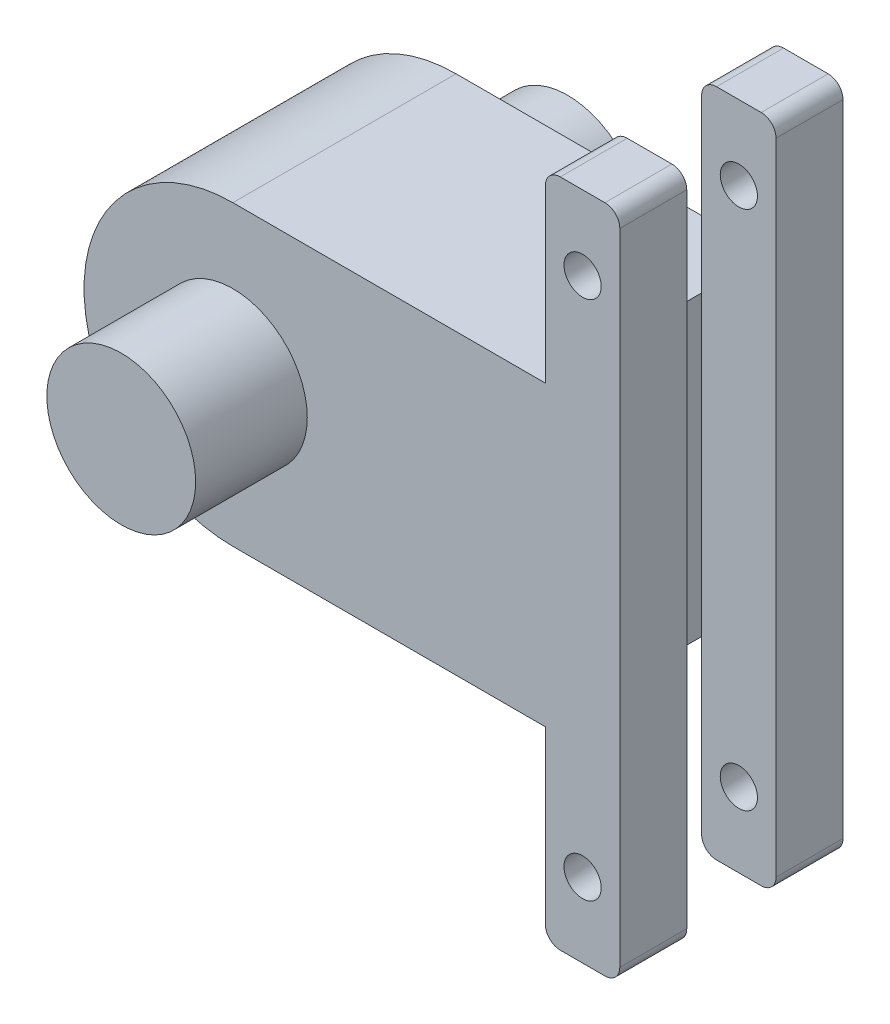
from build123d import *

# Parameters (mm, degrees)
SKETCH1_R           = 2.5
BOSS_EXTRUDE1_DEPTH = 30
SKETCH2_R           = 10
BOSS_EXTRUDE2_DEPTH = 15
SKETCH4_W           = 10
SKETCH4_H           = 12
CUT_EXTRUDE1_DEPTH  = 119.190524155
FILLET1_R           = 2


with BuildPart() as part:
    # Sketch1 → Boss-Extrude1 (new body)
    with BuildSketch(Plane.XY):
        with BuildLine():
            Line((0, -45), (0, -20))
            Line((0, -20), (-42, -20))
            ThreePointArc((-42, -20), (-62, 0), (-42, 20))
            Line((-42, 20), (0, 20))
            Line((0, 20), (0, 45))
            Line((0, 45), (10, 45))
            Line((10, 45), (10, -45))
            Line((10, -45), (0, -45))
        make_face()
        with Locations((5, 35)):
            Circle(SKETCH1_R, mode=Mode.SUBTRACT)
        with Locations(Location((5, -35, 0), (0, 0, 180))):
            Circle(SKETCH1_R, mode=Mode.SUBTRACT)
    extrude(amount=BOSS_EXTRUDE1_DEPTH)

    # Sketch2 → Boss-Extrude2 (add)
    with BuildSketch(Plane.XY.offset(30)):
        with Locations((-42, 0)):
            Circle(SKETCH2_R)
    boss_extrude2 = extrude(amount=BOSS_EXTRUDE2_DEPTH)

    # Mirror1: Boss-Extrude2 across plane
    add(boss_extrude2.mirror(Plane.XY.offset(15)))

    # Sketch4 → Cut-Extrude1 (cut, through all)
    with BuildSketch(Plane.XZ.offset(45)):
        with Locations((5, 15)):
            Rectangle(SKETCH4_W, SKETCH4_H)
    extrude(amount=-CUT_EXTRUDE1_DEPTH, mode=Mode.SUBTRACT)

    # Fillet1
    fillet1_edges = [part.edges().sort_by_distance(p)[0] for p in [
        (0, 45, 25.5),
        (10, 45, 25.5),
        (10, -45, 25.5),
        (0, -45, 25.5),
        (0, 45, 4.5),
        (10, 45, 4.5),
        (10, -45, 4.5),
        (0, -45, 4.5),
    ]]
    fillet(fillet1_edges, radius=FILLET1_R)


solid = part.part
